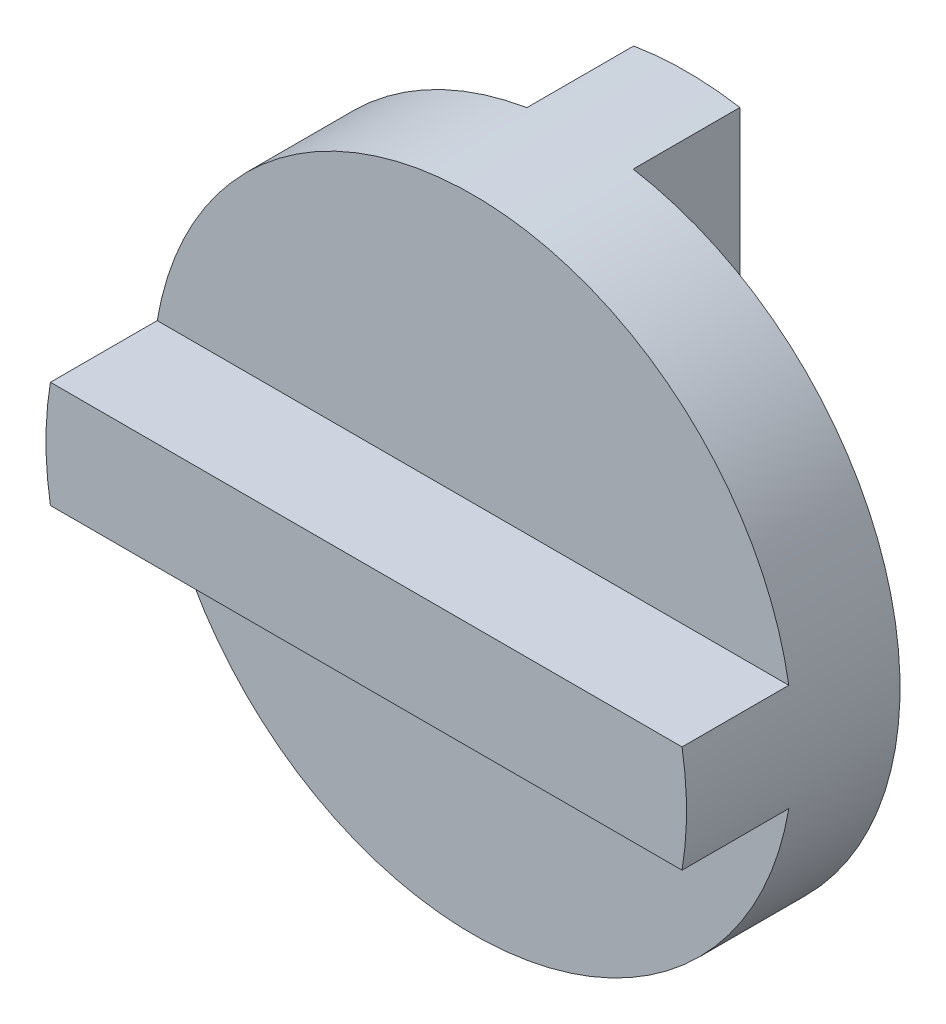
from build123d import *
from build123d.topology import SkipClean

# Parameters (mm, degrees)
ESQUISSE2_R        = 30
BOSS_EXTRU_1_DEPTH = 10
BOSS_EXTRU_5_DEPTH = 10
BOSS_EXTRU_6_START = 10
BOSS_EXTRU_6_DEPTH = 10


with BuildPart() as part:
    # Esquisse2 → Boss.-Extru.1 (new body)
    with BuildSketch(Plane.XY):
        Circle(ESQUISSE2_R)
    extrude(amount=BOSS_EXTRU_1_DEPTH)

    # Esquisse3 → Boss.-Extru.5 (add)
    with SkipClean():  # the faces are left unmerged after this step: merging them gives an invalid solid
        with BuildSketch(Plane.XY.offset(10)):
            with BuildLine():
                Line((-29.580398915, 5), (29.580398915, 5))
                ThreePointArc((29.580398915, 5), (29.894915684, 2.508787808), (30, 0))
                ThreePointArc((30, 0), (29.894915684, -2.508787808), (29.580398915, -5))
                Line((29.580398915, -5), (-29.580398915, -5))
                ThreePointArc((-29.580398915, -5), (-29.894915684, -2.508787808), (-30, 0))
                ThreePointArc((-30, 0), (-29.894915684, 2.508787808), (-29.580398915, 5))
            make_face()
        extrude(amount=BOSS_EXTRU_5_DEPTH)

    # Esquisse5 → Boss.-Extru.6 (add)
    with SkipClean():  # the faces are left unmerged after this step: merging them gives an invalid solid
        with BuildSketch(Plane(origin=(0, 0, 0), x_dir=(-1, 0, 0), z_dir=(0, 0, -1)).offset(BOSS_EXTRU_6_START)):
            with BuildLine():
                Line((-5, 29.580398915), (-5, -29.580398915))
                ThreePointArc((-5, -29.580398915), (-2.508787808, -29.894915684), (0, -30))
                ThreePointArc((0, -30), (2.486595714, -29.896769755), (4.956078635, -29.58778945))
                Line((4.956078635, -29.58778945), (4.956078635, 29.58778945))
                ThreePointArc((4.956078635, 29.58778945), (2.486595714, 29.896769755), (0, 30))
                ThreePointArc((0, 30), (-2.508787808, 29.894915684), (-5, 29.580398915))
            make_face()
        extrude(amount=-BOSS_EXTRU_6_DEPTH)


solid = part.part
